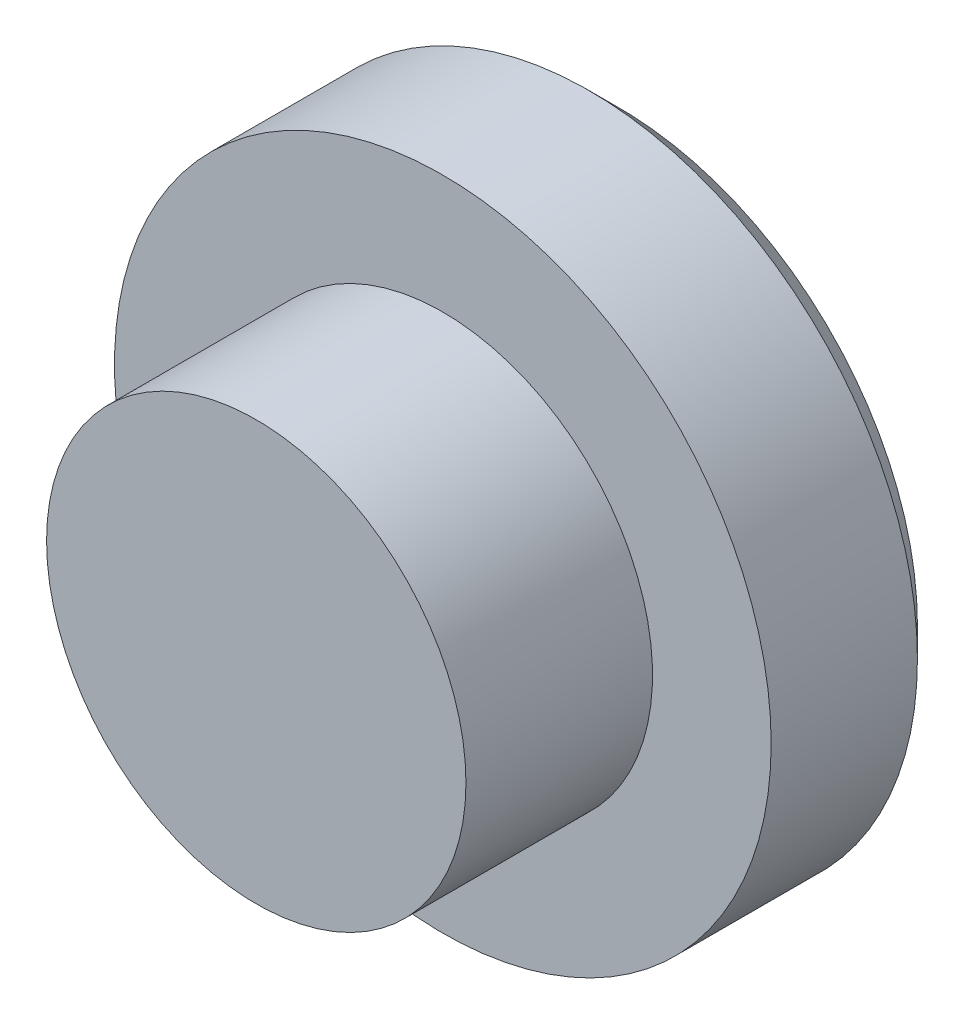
ISO-10303-21;
HEADER;
FILE_DESCRIPTION(('STEP AP214'),'2;1');
FILE_NAME('part.step','',(''),(''),'','','');
FILE_SCHEMA(('AUTOMOTIVE_DESIGN { 1 0 10303 214 1 1 1 1 }'));
ENDSEC;
DATA;
#1=APPLICATION_CONTEXT('core data for automotive mechanical design processes');
#2=APPLICATION_PROTOCOL_DEFINITION('international standard','automotive_design',2000,#1);
#3=PRODUCT_CONTEXT('',#1,'mechanical');
#4=PRODUCT('Part','Part','',(#3));
#5=PRODUCT_RELATED_PRODUCT_CATEGORY('part','',(#4));
#6=PRODUCT_DEFINITION_FORMATION('','',#4);
#7=PRODUCT_DEFINITION_CONTEXT('part definition',#1,'design');
#8=PRODUCT_DEFINITION('design','',#6,#7);
#9=PRODUCT_DEFINITION_SHAPE('','',#8);
#10=(LENGTH_UNIT() NAMED_UNIT(*) SI_UNIT(.MILLI.,.METRE.));
#11=(NAMED_UNIT(*) PLANE_ANGLE_UNIT() SI_UNIT($,.RADIAN.));
#12=(NAMED_UNIT(*) SI_UNIT($,.STERADIAN.) SOLID_ANGLE_UNIT());
#13=UNCERTAINTY_MEASURE_WITH_UNIT(LENGTH_MEASURE(1.E-05),#10,'distance_accuracy_value','');
#14=(GEOMETRIC_REPRESENTATION_CONTEXT(3) GLOBAL_UNCERTAINTY_ASSIGNED_CONTEXT((#13)) GLOBAL_UNIT_ASSIGNED_CONTEXT((#10,
#11,#12)) REPRESENTATION_CONTEXT('',''));
#15=CARTESIAN_POINT('',(0.,0.,0.));
#16=DIRECTION('',(0.,0.,1.));
#17=DIRECTION('',(1.,0.,0.));
#18=AXIS2_PLACEMENT_3D('',#15,#16,#17);
#19=CARTESIAN_POINT('',(0.,0.,3.175));
#20=DIRECTION('',(0.,0.,-1.));
#21=DIRECTION('',(-1.,0.,0.));
#22=AXIS2_PLACEMENT_3D('',#19,#20,#21);
#23=CYLINDRICAL_SURFACE('',#22,3.5687);
#24=CARTESIAN_POINT('',(0.,0.,3.175));
#25=DIRECTION('',(0.,0.,1.));
#26=DIRECTION('',(1.,0.,0.));
#27=AXIS2_PLACEMENT_3D('',#24,#25,#26);
#28=CIRCLE('',#27,3.5687);
#29=CARTESIAN_POINT('',(3.5687,0.,3.175));
#30=VERTEX_POINT('',#29);
#31=EDGE_CURVE('E46',#30,#30,#28,.T.);
#32=ORIENTED_EDGE('',*,*,#31,.F.);
#33=EDGE_LOOP('',(#32));
#34=FACE_BOUND('',#33,.T.);
#35=CARTESIAN_POINT('',(0.,0.,0.));
#36=DIRECTION('',(0.,0.,-1.));
#37=DIRECTION('',(-1.,0.,0.));
#38=AXIS2_PLACEMENT_3D('',#35,#36,#37);
#39=CIRCLE('',#38,3.5687);
#40=CARTESIAN_POINT('',(-3.5687,0.,0.));
#41=VERTEX_POINT('',#40);
#42=EDGE_CURVE('E50',#41,#41,#39,.T.);
#43=ORIENTED_EDGE('',*,*,#42,.F.);
#44=EDGE_LOOP('',(#43));
#45=FACE_BOUND('',#44,.T.);
#46=ADVANCED_FACE('F35',(#34,#45),#23,.T.);
#47=CARTESIAN_POINT('',(0.,0.,3.175));
#48=DIRECTION('',(0.,0.,1.));
#49=DIRECTION('',(1.,0.,0.));
#50=AXIS2_PLACEMENT_3D('',#47,#48,#49);
#51=PLANE('',#50);
#52=ORIENTED_EDGE('',*,*,#31,.T.);
#53=EDGE_LOOP('',(#52));
#54=FACE_BOUND('',#53,.T.);
#55=ADVANCED_FACE('F64',(#54),#51,.T.);
#56=CARTESIAN_POINT('',(0.,0.,0.));
#57=DIRECTION('',(0.,0.,-1.));
#58=DIRECTION('',(-1.,0.,0.));
#59=AXIS2_PLACEMENT_3D('',#56,#57,#58);
#60=PLANE('',#59);
#61=CARTESIAN_POINT('',(0.,0.,0.));
#62=DIRECTION('',(0.,0.,-1.));
#63=DIRECTION('',(-1.,0.,0.));
#64=AXIS2_PLACEMENT_3D('',#61,#62,#63);
#65=CIRCLE('',#64,5.588);
#66=CARTESIAN_POINT('',(5.588,0.,0.));
#67=VERTEX_POINT('',#66);
#68=EDGE_CURVE('E55',#67,#67,#65,.T.);
#69=ORIENTED_EDGE('',*,*,#68,.F.);
#70=EDGE_LOOP('',(#69));
#71=FACE_BOUND('',#70,.T.);
#72=ORIENTED_EDGE('',*,*,#42,.T.);
#73=EDGE_LOOP('',(#72));
#74=FACE_BOUND('',#73,.T.);
#75=ADVANCED_FACE('F61',(#71,#74),#60,.F.);
#76=CARTESIAN_POINT('',(0.,0.,-2.9972));
#77=DIRECTION('',(0.,0.,1.));
#78=DIRECTION('',(1.,0.,0.));
#79=AXIS2_PLACEMENT_3D('',#76,#77,#78);
#80=CYLINDRICAL_SURFACE('',#79,5.588);
#81=CARTESIAN_POINT('',(0.,0.,-2.48920000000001));
#82=DIRECTION('',(0.,0.,-1.));
#83=DIRECTION('',(-1.,0.,0.));
#84=AXIS2_PLACEMENT_3D('',#81,#82,#83);
#85=CIRCLE('',#84,5.588);
#86=CARTESIAN_POINT('',(5.588,0.,-2.48920000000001));
#87=VERTEX_POINT('',#86);
#88=EDGE_CURVE('E10',#87,#87,#85,.F.);
#89=CARTESIAN_POINT('',(5.588,0.,-2.48920000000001));
#90=CARTESIAN_POINT('',(5.588,0.,-2.46327083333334));
#91=CARTESIAN_POINT('',(5.588,0.,-2.43734166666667));
#92=CARTESIAN_POINT('',(5.588,0.,-2.38548333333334));
#93=CARTESIAN_POINT('',(5.588,0.,-2.35955416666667));
#94=CARTESIAN_POINT('',(5.588,0.,-2.30769583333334));
#95=CARTESIAN_POINT('',(5.588,0.,-2.28176666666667));
#96=CARTESIAN_POINT('',(5.588,0.,-2.22990833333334));
#97=CARTESIAN_POINT('',(5.588,0.,-2.20397916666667));
#98=CARTESIAN_POINT('',(5.588,0.,-2.15212083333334));
#99=CARTESIAN_POINT('',(5.588,0.,-2.12619166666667));
#100=CARTESIAN_POINT('',(5.588,0.,-2.07433333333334));
#101=CARTESIAN_POINT('',(5.588,0.,-2.04840416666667));
#102=CARTESIAN_POINT('',(5.588,0.,-1.99654583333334));
#103=CARTESIAN_POINT('',(5.588,0.,-1.97061666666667));
#104=CARTESIAN_POINT('',(5.588,0.,-1.91875833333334));
#105=CARTESIAN_POINT('',(5.588,0.,-1.89282916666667));
#106=CARTESIAN_POINT('',(5.588,0.,-1.84097083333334));
#107=CARTESIAN_POINT('',(5.588,0.,-1.81504166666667));
#108=CARTESIAN_POINT('',(5.588,0.,-1.76318333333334));
#109=CARTESIAN_POINT('',(5.588,0.,-1.73725416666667));
#110=CARTESIAN_POINT('',(5.588,0.,-1.68539583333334));
#111=CARTESIAN_POINT('',(5.588,0.,-1.65946666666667));
#112=CARTESIAN_POINT('',(5.588,0.,-1.60760833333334));
#113=CARTESIAN_POINT('',(5.588,0.,-1.58167916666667));
#114=CARTESIAN_POINT('',(5.588,0.,-1.52982083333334));
#115=CARTESIAN_POINT('',(5.588,0.,-1.50389166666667));
#116=CARTESIAN_POINT('',(5.588,0.,-1.45203333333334));
#117=CARTESIAN_POINT('',(5.588,0.,-1.42610416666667));
#118=CARTESIAN_POINT('',(5.588,0.,-1.37424583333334));
#119=CARTESIAN_POINT('',(5.588,0.,-1.34831666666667));
#120=CARTESIAN_POINT('',(5.588,0.,-1.29645833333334));
#121=CARTESIAN_POINT('',(5.588,0.,-1.27052916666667));
#122=CARTESIAN_POINT('',(5.588,0.,-1.21867083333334));
#123=CARTESIAN_POINT('',(5.588,0.,-1.19274166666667));
#124=CARTESIAN_POINT('',(5.588,0.,-1.14088333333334));
#125=CARTESIAN_POINT('',(5.588,0.,-1.11495416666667));
#126=CARTESIAN_POINT('',(5.588,0.,-1.06309583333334));
#127=CARTESIAN_POINT('',(5.588,0.,-1.03716666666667));
#128=CARTESIAN_POINT('',(5.588,0.,-0.985308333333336));
#129=CARTESIAN_POINT('',(5.588,0.,-0.959379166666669));
#130=CARTESIAN_POINT('',(5.588,0.,-0.907520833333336));
#131=CARTESIAN_POINT('',(5.588,0.,-0.881591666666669));
#132=CARTESIAN_POINT('',(5.588,0.,-0.829733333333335));
#133=CARTESIAN_POINT('',(5.588,0.,-0.803804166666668));
#134=CARTESIAN_POINT('',(5.588,0.,-0.751945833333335));
#135=CARTESIAN_POINT('',(5.588,0.,-0.726016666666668));
#136=CARTESIAN_POINT('',(5.588,0.,-0.674158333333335));
#137=CARTESIAN_POINT('',(5.588,0.,-0.648229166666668));
#138=CARTESIAN_POINT('',(5.588,0.,-0.596370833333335));
#139=CARTESIAN_POINT('',(5.588,0.,-0.570441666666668));
#140=CARTESIAN_POINT('',(5.588,0.,-0.518583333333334));
#141=CARTESIAN_POINT('',(5.588,0.,-0.492654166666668));
#142=CARTESIAN_POINT('',(5.588,0.,-0.440795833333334));
#143=CARTESIAN_POINT('',(5.588,0.,-0.414866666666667));
#144=CARTESIAN_POINT('',(5.588,0.,-0.363008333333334));
#145=CARTESIAN_POINT('',(5.588,0.,-0.337079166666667));
#146=CARTESIAN_POINT('',(5.588,0.,-0.285220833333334));
#147=CARTESIAN_POINT('',(5.588,0.,-0.259291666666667));
#148=CARTESIAN_POINT('',(5.588,0.,-0.207433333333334));
#149=CARTESIAN_POINT('',(5.588,0.,-0.181504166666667));
#150=CARTESIAN_POINT('',(5.588,0.,-0.129645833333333));
#151=CARTESIAN_POINT('',(5.588,0.,-0.103716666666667));
#152=CARTESIAN_POINT('',(5.588,0.,-0.0518583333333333));
#153=CARTESIAN_POINT('',(5.588,0.,-0.0259291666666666));
#154=CARTESIAN_POINT('',(5.588,0.,0.));
#155=B_SPLINE_CURVE_WITH_KNOTS('',3,(#89,#90,#91,#92,#93,#94,#95,#96,#97,#98,#99,#100,#101,#102,
#103,#104,#105,#106,#107,#108,#109,#110,#111,#112,#113,#114,#115,#116,#117,#118,#119,#120,#121,
#122,#123,#124,#125,#126,#127,#128,#129,#130,#131,#132,#133,#134,#135,#136,#137,#138,#139,#140,
#141,#142,#143,#144,#145,#146,#147,#148,#149,#150,#151,#152,#153,#154),.UNSPECIFIED.,.F.,.F.,(4,
2,2,2,2,2,2,2,2,2,2,2,2,2,2,2,2,2,2,2,2,2,2,2,2,2,2,2,2,2,2,2,4),(0.,0.0777875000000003,
0.155575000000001,0.233362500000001,0.311150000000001,0.388937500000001,0.466725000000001,
0.544512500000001,0.622300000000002,0.700087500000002,0.777875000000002,0.855662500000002,
0.933450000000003,1.0112375,1.089025,1.1668125,1.2446,1.3223875,1.400175,1.4779625,1.55575,
1.6335375,1.711325,1.7891125,1.8669,1.94468750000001,2.022475,2.10026250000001,2.17805000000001,
2.25583750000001,2.33362500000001,2.41141250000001,2.48920000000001),.UNSPECIFIED.);
#156=EDGE_CURVE('BSEAM59',#87,#67,#155,.T.);
#157=ORIENTED_EDGE('',*,*,#88,.T.);
#158=ORIENTED_EDGE('',*,*,#68,.T.);
#159=ORIENTED_EDGE('',*,*,#156,.T.);
#160=ORIENTED_EDGE('',*,*,#156,.F.);
#161=EDGE_LOOP('',(#157,#159,#158,#160));
#162=FACE_BOUND('',#161,.T.);
#163=ADVANCED_FACE('F59',(#162),#80,.T.);
#164=CARTESIAN_POINT('',(0.,0.,-2.9972));
#165=DIRECTION('',(0.,0.,-1.));
#166=DIRECTION('',(-1.,0.,0.));
#167=AXIS2_PLACEMENT_3D('',#164,#165,#166);
#168=PLANE('',#167);
#169=CARTESIAN_POINT('',(0.,0.,-2.9972));
#170=DIRECTION('',(0.,0.,-1.));
#171=DIRECTION('',(-1.,0.,0.));
#172=AXIS2_PLACEMENT_3D('',#169,#170,#171);
#173=CIRCLE('',#172,5.08000000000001);
#174=CARTESIAN_POINT('',(-5.08000000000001,0.,-2.9972));
#175=VERTEX_POINT('',#174);
#176=EDGE_CURVE('E42',#175,#175,#173,.T.);
#177=ORIENTED_EDGE('',*,*,#176,.T.);
#178=EDGE_LOOP('',(#177));
#179=FACE_BOUND('',#178,.T.);
#180=ADVANCED_FACE('F78',(#179),#168,.T.);
#181=CARTESIAN_POINT('',(0.,0.,-2.9972));
#182=DIRECTION('',(0.,0.,1.));
#183=DIRECTION('',(1.,0.,0.));
#184=AXIS2_PLACEMENT_3D('',#181,#182,#183);
#185=CONICAL_SURFACE('',#184,5.08000000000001,0.785398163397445);
#186=ORIENTED_EDGE('',*,*,#88,.F.);
#187=EDGE_LOOP('',(#186));
#188=FACE_BOUND('',#187,.T.);
#189=ORIENTED_EDGE('',*,*,#176,.F.);
#190=EDGE_LOOP('',(#189));
#191=FACE_BOUND('',#190,.T.);
#192=ADVANCED_FACE('F37',(#188,#191),#185,.T.);
#193=CLOSED_SHELL('',(#46,#55,#75,#163,#180,#192));
#194=MANIFOLD_SOLID_BREP('B2',#193);
#195=ADVANCED_BREP_SHAPE_REPRESENTATION('',(#18,#194),#14);
#196=SHAPE_DEFINITION_REPRESENTATION(#9,#195);
ENDSEC;
END-ISO-10303-21;
